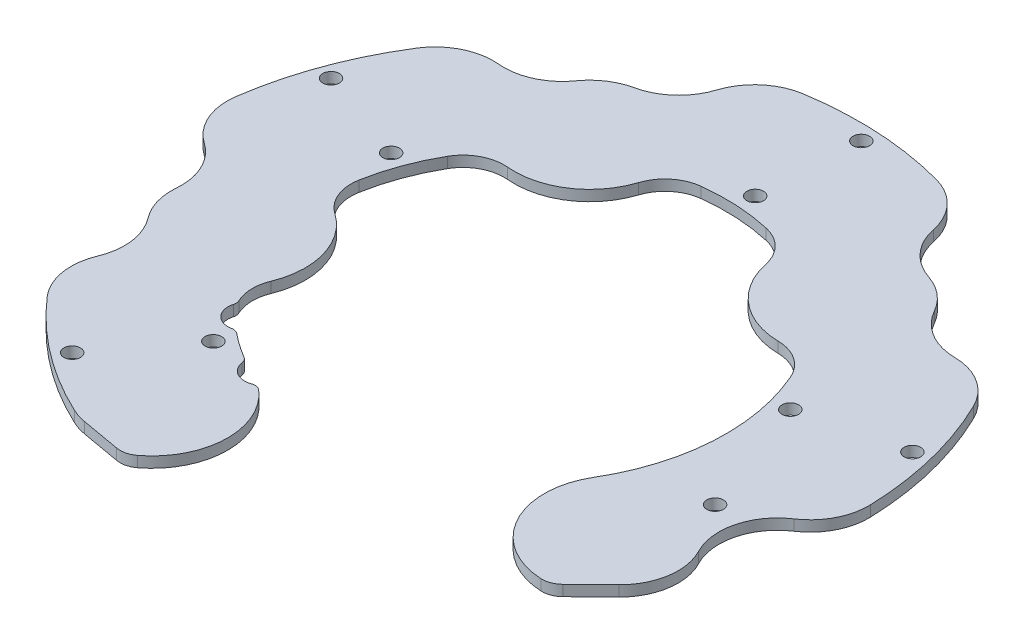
from build123d import *

# Parameters (mm, degrees)
BOSS_EXTRUDE1_DEPTH          = 3.175
BOSS_EXTRUDE2_START          = -3.175
BOSS_EXTRUDE2_DEPTH          = 3.175
F_10_0_1935_DIAMETER_HOLE1_D = 4.9149


with BuildPart() as part:
    # Sketch1 → Boss-Extrude1 (new body)
    with BuildSketch(Plane(origin=(0, 0, 0), x_dir=(1, 0, 0), z_dir=(0, 1, 0))):
        with BuildLine():
            ThreePointArc((56.104408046, -33.36933745), (65.154662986, -4.010882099), (59.773674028, 26.235951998))
            ThreePointArc((59.773674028, 26.235951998), (53.518032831, 33.679174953), (44.232955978, 36.563956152))
            ThreePointArc((44.232955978, 36.563956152), (33.502265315, 40.522145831), (27.597548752, 50.317517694))
            ThreePointArc((27.597548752, 50.317517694), (23.018843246, 58.894817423), (14.532407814, 63.63981778))
            ThreePointArc((14.532407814, 63.63981778), (3.509267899, 65.183604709), (-7.615902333, 64.832208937))
            ThreePointArc((-7.615902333, 64.832208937), (-16.562719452, 61.025756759), (-22.035837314, 52.989613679))
            ThreePointArc((-22.035837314, 52.989613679), (-28.958076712, 43.884802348), (-40.051703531, 41.101561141))
            ThreePointArc((-40.051703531, 41.101561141), (-49.592828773, 39.23031988), (-56.61143268, 32.501738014))
            ThreePointArc((-56.61143268, 32.501738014), (-61.310233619, 22.411437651), (-64.226468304, 11.669535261))
            ThreePointArc((-64.226468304, 11.669535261), (-63.201768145, 2.000791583), (-57.116662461, -5.582486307))
            ThreePointArc((-57.116662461, -5.582486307), (-50.433201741, -14.863991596), (-51.014602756, -26.286642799))
            ThreePointArc((-51.014602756, -26.286642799), (-52.014312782, -35.9580023), (-47.63144879, -44.637006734))
            ThreePointArc((-47.63144879, -44.637006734), (-38.304343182, -52.858249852), (-27.58767489, -59.161959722))
            ThreePointArc((-27.58767489, -59.161959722), (-19.233389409, -82.115170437), (-42.186600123, -90.469455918))
            ThreePointArc((-42.186600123, -90.469455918), (-60.181848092, -79.640296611), (-75.513001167, -65.285667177))
            ThreePointArc((-75.513001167, -65.285667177), (-79.49647233, -56.753871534), (-78.412979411, -47.400496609))
            ThreePointArc((-78.412979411, -47.400496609), (-77.257535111, -38.534827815), (-80.689725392, -30.279211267))
            ThreePointArc((-80.689725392, -30.279211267), (-83.568058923, -24.629705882), (-84.213774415, -18.322189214))
            ThreePointArc((-84.213774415, -18.322189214), (-85.807568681, -9.524748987), (-91.586555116, -2.702839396))
            ThreePointArc((-91.586555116, -2.702839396), (-97.569594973, 4.56784238), (-98.850010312, 13.8962997))
            ThreePointArc((-98.850010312, 13.8962997), (-93.754559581, 34.271186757), (-84.508836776, 53.12897694))
            ThreePointArc((-84.508836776, 53.12897694), (-77.51425435, 59.432578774), (-68.25273011, 61.130739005))
            ThreePointArc((-68.25273011, 61.130739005), (-59.436573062, 62.617517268), (-52.544946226, 68.313183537))
            ThreePointArc((-52.544946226, 68.313183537), (-47.983673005, 72.717329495), (-42.140460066, 75.178747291))
            ThreePointArc((-42.140460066, 75.178747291), (-34.193250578, 79.274720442), (-29.358751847, 86.795541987))
            ThreePointArc((-29.358751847, 86.795541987), (-24.154737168, 94.642695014), (-15.608095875, 98.594213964))
            ThreePointArc((-15.608095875, 98.594213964), (5.36631239, 99.677652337), (26.103167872, 96.348618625))
            ThreePointArc((26.103167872, 96.348618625), (34.176165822, 91.502353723), (38.507613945, 83.141843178))
            ThreePointArc((38.507613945, 83.141843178), (42.50671758, 75.14544994), (49.968239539, 70.219922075))
            ThreePointArc((49.968239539, 70.219922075), (55.513415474, 67.145391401), (59.57548585, 62.276993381))
            ThreePointArc((59.57548585, 62.276993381), (65.815779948, 55.874348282), (74.421355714, 53.449642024))
            ThreePointArc((74.421355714, 53.449642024), (83.447030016, 50.766960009), (89.724415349, 43.748839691))
            ThreePointArc((89.724415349, 43.748839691), (96.892084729, 24.00740721), (99.770591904, 3.203228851))
            ThreePointArc((99.770591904, 3.203228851), (97.84827123, -5.287159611), (92.028968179, -11.761549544))
            ThreePointArc((92.028968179, -11.761549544), (84.824989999, -21.86151229), (86.249801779, -34.185329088))
            ThreePointArc((86.249801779, -34.185329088), (70.481797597, -59.464254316), (56.104408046, -33.36933745))
        make_face()
    extrude(amount=BOSS_EXTRUDE1_DEPTH)

    # Sketch4 → Boss-Extrude2 (add)
    with BuildSketch(Plane(origin=(0, 3.175, 0), x_dir=(1, 0, 0), z_dir=(0, 1, 0)).offset(BOSS_EXTRUDE2_START)):
        with BuildLine():
            Line((-37.886388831, -91.82530733), (-26.369024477, -93.856129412))
            ThreePointArc((-26.369024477, -93.856129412), (-23.786266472, -93.777697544), (-21.448589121, -92.676763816))
            ThreePointArc((-21.448589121, -92.676763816), (-12.547299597, -75.552963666), (-20.3002167, -57.879543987))
            ThreePointArc((-20.3002167, -57.879543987), (-21.51406192, -57.303172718), (-22.852103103, -57.426743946))
            ThreePointArc((-22.852103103, -57.426743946), (-27.195405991, -57.062882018), (-29.658107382, -53.466803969))
            ThreePointArc((-29.658107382, -53.466803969), (-30.063010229, -52.440979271), (-30.864527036, -51.683461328))
            ThreePointArc((-30.864527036, -51.683461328), (-34.517850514, -49.318527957), (-37.99076744, -46.695832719))
            ThreePointArc((-37.99076744, -46.695832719), (-38.976002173, -46.202387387), (-40.077496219, -46.172610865))
            ThreePointArc((-40.077496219, -46.172610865), (-44.792474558, -44.6152696), (-45.926967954, -39.781093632))
            ThreePointArc((-45.926967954, -39.781093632), (-45.835901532, -38.878159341), (-46.068066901, -38.000843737))
            ThreePointArc((-46.068066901, -38.000843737), (-47.216767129, -33.131135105), (-46.31282994, -28.21011164))
            ThreePointArc((-46.31282994, -28.21011164), (-45.560428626, -13.427857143), (-54.209613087, -1.416497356))
            ThreePointArc((-54.209613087, -1.416497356), (-58.504981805, 3.936404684), (-59.228299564, 10.761400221))
            ThreePointArc((-59.228299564, 10.761400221), (-56.539009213, 20.6673569), (-52.205873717, 29.97241988))
            ThreePointArc((-52.205873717, 29.97241988), (-47.251565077, 34.72200708), (-40.516653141, 36.042883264))
            ThreePointArc((-40.516653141, 36.042883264), (-26.160194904, 39.644724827), (-17.202002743, 51.427421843))
            ThreePointArc((-17.202002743, 51.427421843), (-13.338625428, 57.099993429), (-7.023225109, 59.786900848))
            ThreePointArc((-7.023225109, 59.786900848), (3.23617312, 60.110950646), (13.401481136, 58.687302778))
            ThreePointArc((13.401481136, 58.687302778), (19.391906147, 55.337890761), (22.623933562, 49.283326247))
            ThreePointArc((22.623933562, 49.283326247), (30.265331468, 36.606962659), (44.15210762, 31.484599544))
            ThreePointArc((44.15210762, 31.484599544), (50.706279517, 29.448283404), (55.122026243, 24.194243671))
            ThreePointArc((55.122026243, 24.194243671), (60.084261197, -3.698751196), (51.738306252, -30.77250185))
            ThreePointArc((51.738306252, -30.77250185), (51.264695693, -52.78791272), (69.896005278, -64.525754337))
            ThreePointArc((69.896005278, -64.525754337), (72.447866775, -64.119806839), (74.626720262, -62.730782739))
            Line((74.626720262, -62.730782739), (83.00290205, -54.569073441))
            ThreePointArc((83.00290205, -54.569073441), (60.257820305, -55.763878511), (56.104408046, -33.36933745))
            ThreePointArc((56.104408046, -33.36933745), (65.154662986, -4.010882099), (59.773674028, 26.235951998))
            ThreePointArc((59.773674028, 26.235951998), (53.518032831, 33.679174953), (44.232955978, 36.563956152))
            ThreePointArc((44.232955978, 36.563956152), (33.502265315, 40.522145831), (27.597548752, 50.317517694))
            ThreePointArc((27.597548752, 50.317517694), (23.018843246, 58.894817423), (14.532407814, 63.63981778))
            ThreePointArc((14.532407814, 63.63981778), (3.509267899, 65.183604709), (-7.615902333, 64.832208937))
            ThreePointArc((-7.615902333, 64.832208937), (-16.562719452, 61.025756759), (-22.035837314, 52.989613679))
            ThreePointArc((-22.035837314, 52.989613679), (-28.958076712, 43.884802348), (-40.051703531, 41.101561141))
            ThreePointArc((-40.051703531, 41.101561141), (-49.592828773, 39.23031988), (-56.61143268, 32.501738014))
            ThreePointArc((-56.61143268, 32.501738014), (-61.310233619, 22.411437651), (-64.226468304, 11.669535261))
            ThreePointArc((-64.226468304, 11.669535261), (-63.201768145, 2.000791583), (-57.116662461, -5.582486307))
            ThreePointArc((-57.116662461, -5.582486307), (-50.433201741, -14.863991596), (-51.014602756, -26.286642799))
            ThreePointArc((-51.014602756, -26.286642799), (-52.014312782, -35.9580023), (-47.63144879, -44.637006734))
            ThreePointArc((-47.63144879, -44.637006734), (-38.304343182, -52.858249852), (-27.58767489, -59.161959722))
            ThreePointArc((-27.58767489, -59.161959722), (-18.414538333, -80.009498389), (-37.886388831, -91.82530733))
        make_face()
    extrude(amount=BOSS_EXTRUDE2_DEPTH)

    # 10 _0.1935_ Diameter Hole1 (through all)
    with Locations(Plane(origin=(0, 3.175, 0), x_dir=(1, 0, 0), z_dir=(0, 1, 0))):
        with Locations((-57.425427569, -75.992649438), (-89.460457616, 32.701514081), (5.120527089, 95.11226368), (92.454279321, 22.907831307), (76.728320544, -19.774798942), (-39.432126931, -52.18161928), (-61.429514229, 22.455039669), (3.516095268, 65.31042106), (63.485271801, 15.730044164)):
            Hole(F_10_0_1935_DIAMETER_HOLE1_D / 2)


solid = part.part
